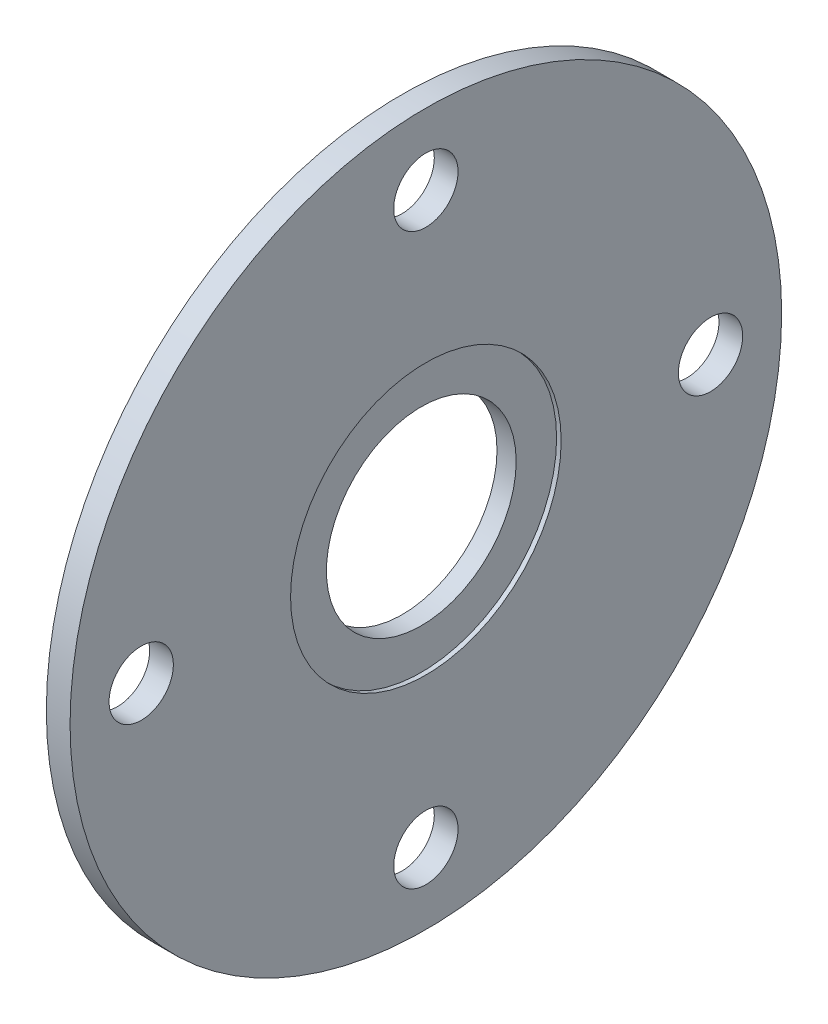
ISO-10303-21;
HEADER;
FILE_DESCRIPTION(('STEP AP214'),'2;1');
FILE_NAME('part.step','',(''),(''),'','','');
FILE_SCHEMA(('AUTOMOTIVE_DESIGN { 1 0 10303 214 1 1 1 1 }'));
ENDSEC;
DATA;
#1=APPLICATION_CONTEXT('core data for automotive mechanical design processes');
#2=APPLICATION_PROTOCOL_DEFINITION('international standard','automotive_design',2000,#1);
#3=PRODUCT_CONTEXT('',#1,'mechanical');
#4=PRODUCT('Part','Part','',(#3));
#5=PRODUCT_RELATED_PRODUCT_CATEGORY('part','',(#4));
#6=PRODUCT_DEFINITION_FORMATION('','',#4);
#7=PRODUCT_DEFINITION_CONTEXT('part definition',#1,'design');
#8=PRODUCT_DEFINITION('design','',#6,#7);
#9=PRODUCT_DEFINITION_SHAPE('','',#8);
#10=(LENGTH_UNIT() NAMED_UNIT(*) SI_UNIT(.MILLI.,.METRE.));
#11=(NAMED_UNIT(*) PLANE_ANGLE_UNIT() SI_UNIT($,.RADIAN.));
#12=(NAMED_UNIT(*) SI_UNIT($,.STERADIAN.) SOLID_ANGLE_UNIT());
#13=UNCERTAINTY_MEASURE_WITH_UNIT(LENGTH_MEASURE(1.E-05),#10,'distance_accuracy_value','');
#14=(GEOMETRIC_REPRESENTATION_CONTEXT(3) GLOBAL_UNCERTAINTY_ASSIGNED_CONTEXT((#13)) GLOBAL_UNIT_ASSIGNED_CONTEXT((#10,
#11,#12)) REPRESENTATION_CONTEXT('',''));
#15=CARTESIAN_POINT('',(0.,0.,0.));
#16=DIRECTION('',(0.,0.,1.));
#17=DIRECTION('',(1.,0.,0.));
#18=AXIS2_PLACEMENT_3D('',#15,#16,#17);
#19=CARTESIAN_POINT('',(1.5875,0.,0.));
#20=DIRECTION('',(-1.,0.,0.));
#21=DIRECTION('',(0.,0.,1.));
#22=AXIS2_PLACEMENT_3D('',#19,#20,#21);
#23=CYLINDRICAL_SURFACE('',#22,6.35);
#24=CARTESIAN_POINT('',(0.,0.,0.));
#25=DIRECTION('',(1.,0.,0.));
#26=DIRECTION('',(0.,0.,-1.));
#27=AXIS2_PLACEMENT_3D('',#24,#25,#26);
#28=CIRCLE('',#27,6.35);
#29=CARTESIAN_POINT('',(0.,0.,-6.35));
#30=VERTEX_POINT('',#29);
#31=EDGE_CURVE('E47',#30,#30,#28,.T.);
#32=ORIENTED_EDGE('',*,*,#31,.F.);
#33=EDGE_LOOP('',(#32));
#34=FACE_BOUND('',#33,.T.);
#35=CARTESIAN_POINT('',(1.2827,0.,0.));
#36=DIRECTION('',(1.,0.,0.));
#37=DIRECTION('',(0.,0.,-1.));
#38=AXIS2_PLACEMENT_3D('',#35,#36,#37);
#39=CIRCLE('',#38,6.35);
#40=CARTESIAN_POINT('',(1.2827,0.,-6.35));
#41=VERTEX_POINT('',#40);
#42=EDGE_CURVE('E38',#41,#41,#39,.T.);
#43=ORIENTED_EDGE('',*,*,#42,.T.);
#44=EDGE_LOOP('',(#43));
#45=FACE_BOUND('',#44,.T.);
#46=ADVANCED_FACE('F34',(#34,#45),#23,.F.);
#47=CARTESIAN_POINT('',(1.5875,0.,0.));
#48=DIRECTION('',(1.,0.,0.));
#49=DIRECTION('',(0.,0.,-1.));
#50=AXIS2_PLACEMENT_3D('',#47,#48,#49);
#51=PLANE('',#50);
#52=CARTESIAN_POINT('',(1.5875,0.,0.));
#53=DIRECTION('',(1.,0.,0.));
#54=DIRECTION('',(0.,0.,-1.));
#55=AXIS2_PLACEMENT_3D('',#52,#53,#54);
#56=CIRCLE('',#55,9.0551);
#57=CARTESIAN_POINT('',(1.5875,0.,-9.0551));
#58=VERTEX_POINT('',#57);
#59=EDGE_CURVE('E75',#58,#58,#56,.T.);
#60=ORIENTED_EDGE('',*,*,#59,.F.);
#61=EDGE_LOOP('',(#60));
#62=FACE_BOUND('',#61,.T.);
#63=CARTESIAN_POINT('',(1.5875,-19.05,0.));
#64=DIRECTION('',(1.,0.,0.));
#65=DIRECTION('',(0.,0.,-1.));
#66=AXIS2_PLACEMENT_3D('',#63,#64,#65);
#67=CIRCLE('',#66,2.15265);
#68=CARTESIAN_POINT('',(1.5875,-19.05,-2.15265));
#69=VERTEX_POINT('',#68);
#70=EDGE_CURVE('E61',#69,#69,#67,.T.);
#71=ORIENTED_EDGE('',*,*,#70,.F.);
#72=EDGE_LOOP('',(#71));
#73=FACE_BOUND('',#72,.T.);
#74=CARTESIAN_POINT('',(1.5875,19.05,0.));
#75=DIRECTION('',(1.,0.,0.));
#76=DIRECTION('',(0.,0.,-1.));
#77=AXIS2_PLACEMENT_3D('',#74,#75,#76);
#78=CIRCLE('',#77,2.15265);
#79=CARTESIAN_POINT('',(1.5875,19.05,-2.15265));
#80=VERTEX_POINT('',#79);
#81=EDGE_CURVE('E51',#80,#80,#78,.T.);
#82=ORIENTED_EDGE('',*,*,#81,.F.);
#83=EDGE_LOOP('',(#82));
#84=FACE_BOUND('',#83,.T.);
#85=CARTESIAN_POINT('',(1.5875,0.,0.));
#86=DIRECTION('',(1.,0.,0.));
#87=DIRECTION('',(0.,0.,-1.));
#88=AXIS2_PLACEMENT_3D('',#85,#86,#87);
#89=CIRCLE('',#88,23.8125);
#90=CARTESIAN_POINT('',(1.5875,0.,-23.8125));
#91=VERTEX_POINT('',#90);
#92=EDGE_CURVE('E10',#91,#91,#89,.T.);
#93=ORIENTED_EDGE('',*,*,#92,.T.);
#94=EDGE_LOOP('',(#93));
#95=FACE_BOUND('',#94,.T.);
#96=CARTESIAN_POINT('',(1.5875,0.,-19.05));
#97=DIRECTION('',(1.,0.,0.));
#98=DIRECTION('',(0.,0.,-1.));
#99=AXIS2_PLACEMENT_3D('',#96,#97,#98);
#100=CIRCLE('',#99,2.15265);
#101=CARTESIAN_POINT('',(1.5875,0.,-21.20265));
#102=VERTEX_POINT('',#101);
#103=EDGE_CURVE('E55',#102,#102,#100,.T.);
#104=ORIENTED_EDGE('',*,*,#103,.F.);
#105=EDGE_LOOP('',(#104));
#106=FACE_BOUND('',#105,.T.);
#107=CARTESIAN_POINT('',(1.5875,0.,19.05));
#108=DIRECTION('',(1.,0.,0.));
#109=DIRECTION('',(0.,0.,-1.));
#110=AXIS2_PLACEMENT_3D('',#107,#108,#109);
#111=CIRCLE('',#110,2.15265);
#112=CARTESIAN_POINT('',(1.5875,0.,16.89735));
#113=VERTEX_POINT('',#112);
#114=EDGE_CURVE('E67',#113,#113,#111,.T.);
#115=ORIENTED_EDGE('',*,*,#114,.F.);
#116=EDGE_LOOP('',(#115));
#117=FACE_BOUND('',#116,.T.);
#118=ADVANCED_FACE('F97',(#62,#73,#84,#95,#106,#117),#51,.T.);
#119=CARTESIAN_POINT('',(0.,0.,0.));
#120=DIRECTION('',(1.,0.,0.));
#121=DIRECTION('',(0.,0.,-1.));
#122=AXIS2_PLACEMENT_3D('',#119,#120,#121);
#123=PLANE('',#122);
#124=CARTESIAN_POINT('',(0.,-19.05,0.));
#125=DIRECTION('',(1.,0.,0.));
#126=DIRECTION('',(0.,0.,-1.));
#127=AXIS2_PLACEMENT_3D('',#124,#125,#126);
#128=CIRCLE('',#127,2.15265);
#129=CARTESIAN_POINT('',(0.,-19.05,-2.15265));
#130=VERTEX_POINT('',#129);
#131=EDGE_CURVE('E64',#130,#130,#128,.T.);
#132=ORIENTED_EDGE('',*,*,#131,.T.);
#133=EDGE_LOOP('',(#132));
#134=FACE_BOUND('',#133,.T.);
#135=CARTESIAN_POINT('',(0.,19.05,0.));
#136=DIRECTION('',(1.,0.,0.));
#137=DIRECTION('',(0.,0.,-1.));
#138=AXIS2_PLACEMENT_3D('',#135,#136,#137);
#139=CIRCLE('',#138,2.15265);
#140=CARTESIAN_POINT('',(0.,19.05,-2.15265));
#141=VERTEX_POINT('',#140);
#142=EDGE_CURVE('E52',#141,#141,#139,.T.);
#143=ORIENTED_EDGE('',*,*,#142,.T.);
#144=EDGE_LOOP('',(#143));
#145=FACE_BOUND('',#144,.T.);
#146=CARTESIAN_POINT('',(0.,0.,0.));
#147=DIRECTION('',(1.,0.,0.));
#148=DIRECTION('',(0.,0.,-1.));
#149=AXIS2_PLACEMENT_3D('',#146,#147,#148);
#150=CIRCLE('',#149,23.8125);
#151=CARTESIAN_POINT('',(0.,0.,-23.8125));
#152=VERTEX_POINT('',#151);
#153=EDGE_CURVE('E42',#152,#152,#150,.T.);
#154=ORIENTED_EDGE('',*,*,#153,.F.);
#155=EDGE_LOOP('',(#154));
#156=FACE_BOUND('',#155,.T.);
#157=ORIENTED_EDGE('',*,*,#31,.T.);
#158=EDGE_LOOP('',(#157));
#159=FACE_BOUND('',#158,.T.);
#160=CARTESIAN_POINT('',(0.,0.,-19.05));
#161=DIRECTION('',(1.,0.,0.));
#162=DIRECTION('',(0.,0.,-1.));
#163=AXIS2_PLACEMENT_3D('',#160,#161,#162);
#164=CIRCLE('',#163,2.15265);
#165=CARTESIAN_POINT('',(0.,0.,-21.20265));
#166=VERTEX_POINT('',#165);
#167=EDGE_CURVE('E58',#166,#166,#164,.T.);
#168=ORIENTED_EDGE('',*,*,#167,.T.);
#169=EDGE_LOOP('',(#168));
#170=FACE_BOUND('',#169,.T.);
#171=CARTESIAN_POINT('',(0.,0.,19.05));
#172=DIRECTION('',(1.,0.,0.));
#173=DIRECTION('',(0.,0.,-1.));
#174=AXIS2_PLACEMENT_3D('',#171,#172,#173);
#175=CIRCLE('',#174,2.15265);
#176=CARTESIAN_POINT('',(0.,0.,16.89735));
#177=VERTEX_POINT('',#176);
#178=EDGE_CURVE('E70',#177,#177,#175,.T.);
#179=ORIENTED_EDGE('',*,*,#178,.T.);
#180=EDGE_LOOP('',(#179));
#181=FACE_BOUND('',#180,.T.);
#182=ADVANCED_FACE('F103',(#134,#145,#156,#159,#170,#181),#123,.F.);
#183=CARTESIAN_POINT('',(1.5875,0.,0.));
#184=DIRECTION('',(-1.,0.,0.));
#185=DIRECTION('',(0.,0.,1.));
#186=AXIS2_PLACEMENT_3D('',#183,#184,#185);
#187=CYLINDRICAL_SURFACE('',#186,23.8125);
#188=ORIENTED_EDGE('',*,*,#92,.F.);
#189=EDGE_LOOP('',(#188));
#190=FACE_BOUND('',#189,.T.);
#191=ORIENTED_EDGE('',*,*,#153,.T.);
#192=EDGE_LOOP('',(#191));
#193=FACE_BOUND('',#192,.T.);
#194=ADVANCED_FACE('F36',(#190,#193),#187,.T.);
#195=CARTESIAN_POINT('',(1.5875,19.05,0.));
#196=DIRECTION('',(-1.,0.,0.));
#197=DIRECTION('',(0.,0.,1.));
#198=AXIS2_PLACEMENT_3D('',#195,#196,#197);
#199=CYLINDRICAL_SURFACE('',#198,2.15265);
#200=ORIENTED_EDGE('',*,*,#81,.T.);
#201=EDGE_LOOP('',(#200));
#202=FACE_BOUND('',#201,.T.);
#203=ORIENTED_EDGE('',*,*,#142,.F.);
#204=EDGE_LOOP('',(#203));
#205=FACE_BOUND('',#204,.T.);
#206=ADVANCED_FACE('F108',(#202,#205),#199,.F.);
#207=CARTESIAN_POINT('',(1.5875,0.,-19.05));
#208=DIRECTION('',(-1.,0.,0.));
#209=DIRECTION('',(0.,0.,1.));
#210=AXIS2_PLACEMENT_3D('',#207,#208,#209);
#211=CYLINDRICAL_SURFACE('',#210,2.15265);
#212=ORIENTED_EDGE('',*,*,#103,.T.);
#213=EDGE_LOOP('',(#212));
#214=FACE_BOUND('',#213,.T.);
#215=ORIENTED_EDGE('',*,*,#167,.F.);
#216=EDGE_LOOP('',(#215));
#217=FACE_BOUND('',#216,.T.);
#218=ADVANCED_FACE('F134',(#214,#217),#211,.F.);
#219=CARTESIAN_POINT('',(1.5875,-19.05,0.));
#220=DIRECTION('',(-1.,0.,0.));
#221=DIRECTION('',(0.,0.,1.));
#222=AXIS2_PLACEMENT_3D('',#219,#220,#221);
#223=CYLINDRICAL_SURFACE('',#222,2.15265);
#224=ORIENTED_EDGE('',*,*,#70,.T.);
#225=EDGE_LOOP('',(#224));
#226=FACE_BOUND('',#225,.T.);
#227=ORIENTED_EDGE('',*,*,#131,.F.);
#228=EDGE_LOOP('',(#227));
#229=FACE_BOUND('',#228,.T.);
#230=ADVANCED_FACE('F128',(#226,#229),#223,.F.);
#231=CARTESIAN_POINT('',(1.5875,0.,19.05));
#232=DIRECTION('',(-1.,0.,0.));
#233=DIRECTION('',(0.,0.,1.));
#234=AXIS2_PLACEMENT_3D('',#231,#232,#233);
#235=CYLINDRICAL_SURFACE('',#234,2.15265);
#236=ORIENTED_EDGE('',*,*,#114,.T.);
#237=EDGE_LOOP('',(#236));
#238=FACE_BOUND('',#237,.T.);
#239=ORIENTED_EDGE('',*,*,#178,.F.);
#240=EDGE_LOOP('',(#239));
#241=FACE_BOUND('',#240,.T.);
#242=ADVANCED_FACE('F93',(#238,#241),#235,.F.);
#243=CARTESIAN_POINT('',(1.2827,0.,0.));
#244=DIRECTION('',(1.,0.,0.));
#245=DIRECTION('',(0.,0.,-1.));
#246=AXIS2_PLACEMENT_3D('',#243,#244,#245);
#247=CYLINDRICAL_SURFACE('',#246,9.0551);
#248=CARTESIAN_POINT('',(1.2827,0.,0.));
#249=DIRECTION('',(1.,0.,0.));
#250=DIRECTION('',(0.,0.,-1.));
#251=AXIS2_PLACEMENT_3D('',#248,#249,#250);
#252=CIRCLE('',#251,9.0551);
#253=CARTESIAN_POINT('',(1.2827,0.,-9.0551));
#254=VERTEX_POINT('',#253);
#255=EDGE_CURVE('E78',#254,#254,#252,.T.);
#256=ORIENTED_EDGE('',*,*,#255,.F.);
#257=EDGE_LOOP('',(#256));
#258=FACE_BOUND('',#257,.T.);
#259=ORIENTED_EDGE('',*,*,#59,.T.);
#260=EDGE_LOOP('',(#259));
#261=FACE_BOUND('',#260,.T.);
#262=ADVANCED_FACE('F88',(#258,#261),#247,.F.);
#263=CARTESIAN_POINT('',(1.2827,0.,0.));
#264=DIRECTION('',(1.,0.,0.));
#265=DIRECTION('',(0.,0.,-1.));
#266=AXIS2_PLACEMENT_3D('',#263,#264,#265);
#267=PLANE('',#266);
#268=ORIENTED_EDGE('',*,*,#42,.F.);
#269=EDGE_LOOP('',(#268));
#270=FACE_BOUND('',#269,.T.);
#271=ORIENTED_EDGE('',*,*,#255,.T.);
#272=EDGE_LOOP('',(#271));
#273=FACE_BOUND('',#272,.T.);
#274=ADVANCED_FACE('F86',(#270,#273),#267,.T.);
#275=CLOSED_SHELL('',(#46,#118,#182,#194,#206,#218,#230,#242,#262,#274));
#276=MANIFOLD_SOLID_BREP('B2',#275);
#277=ADVANCED_BREP_SHAPE_REPRESENTATION('',(#18,#276),#14);
#278=SHAPE_DEFINITION_REPRESENTATION(#9,#277);
ENDSEC;
END-ISO-10303-21;
